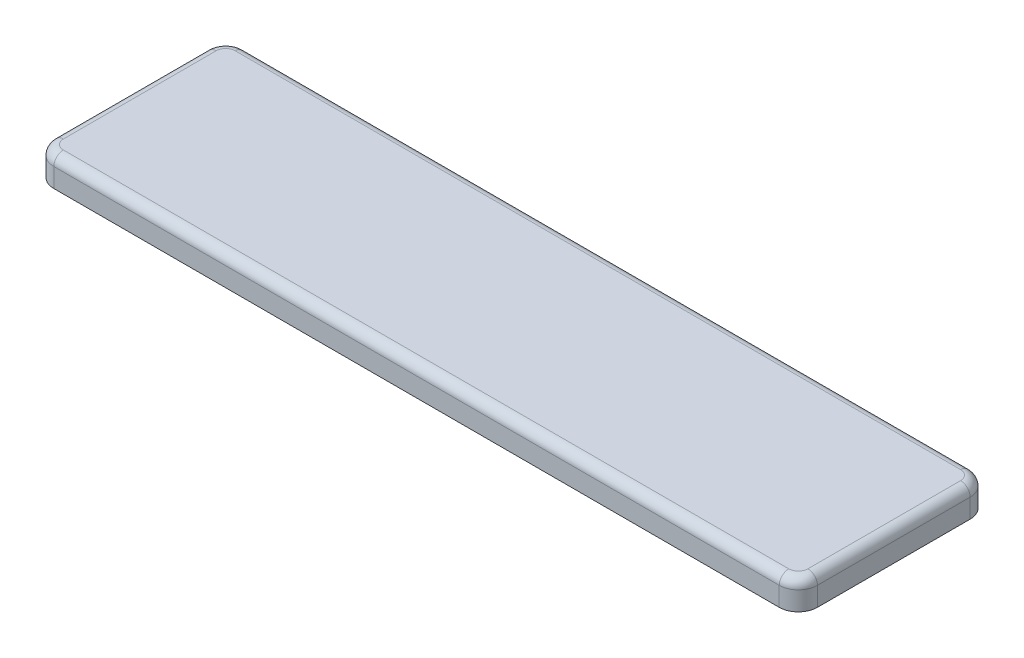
from build123d import *

# Parameters (mm, degrees)
EXTRUDE_1_DEPTH     = 1.5
FILLET_1_R          = 1
CUT_EXTRUDE_2_DEPTH = 1
SKETCH_4_W          = 2.7
SKETCH_4_H          = 4.2
EXTRUDE_4_DEPTH     = 7
FILLET_2_R          = 1


with BuildPart() as part:
    # Sketch 1 → Extrude 1 (new, symmetric)
    with BuildSketch(Plane(origin=(0, 0, 0), x_dir=(0, 0, -1), z_dir=(0, 1, 0))):
        with BuildLine():
            Line((-8, 40), (8, 40))
            ThreePointArc((8, 40), (9.414213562, 39.414213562), (10, 38))
            Line((10, 38), (10, -38))
            ThreePointArc((10, -38), (9.414213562, -39.414213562), (8, -40))
            Line((8, -40), (-8, -40))
            ThreePointArc((-8, -40), (-9.414213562, -39.414213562), (-10, -38))
            Line((-10, -38), (-10, 38))
            ThreePointArc((-10, 38), (-9.414213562, 39.414213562), (-8, 40))
        make_face()
    extrude(amount=EXTRUDE_1_DEPTH, both=True)

    # Fillet 1
    fillet_1_edges = [part.edges().sort_by_distance(p)[0] for p in [
        (-39.414213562, 1.5, 9.414213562),
        (0, 1.5, 10),
        (39.414213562, 1.5, 9.414213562),
        (40, 1.5, 0),
        (39.414213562, 1.5, -9.414213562),
        (0, 1.5, -10),
        (-39.414213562, 1.5, -9.414213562),
        (-40, 1.5, 0),
    ]]
    fillet(fillet_1_edges, radius=FILLET_1_R)

    # Sketch 2 → Cut-Extrude 2 (cut)
    with BuildSketch(Plane.XZ.offset(1.5)):
        with BuildLine():
            Line((-38, 8.8), (38, 8.8))
            ThreePointArc((38, 8.8), (38.565685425, 8.565685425), (38.8, 8))
            Line((38.8, 8), (38.8, -8))
            ThreePointArc((38.8, -8), (38.565685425, -8.565685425), (38, -8.8))
            Line((38, -8.8), (-38, -8.8))
            ThreePointArc((-38, -8.8), (-38.565685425, -8.565685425), (-38.8, -8))
            Line((-38.8, -8), (-38.8, 8))
            ThreePointArc((-38.8, 8), (-38.565685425, 8.565685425), (-38, 8.8))
        make_face()
    extrude(amount=-CUT_EXTRUDE_2_DEPTH, mode=Mode.SUBTRACT)

    # Sketch 4 → Extrude 4 (add)
    with BuildSketch(Plane.XZ.offset(0.5)):
        with Locations((-30, 0)):
            Rectangle(SKETCH_4_W, SKETCH_4_H)
        with Locations((-10, 0)):
            Rectangle(SKETCH_4_W, SKETCH_4_H)
        with Locations((10, 0)):
            Rectangle(SKETCH_4_W, SKETCH_4_H)
        with Locations((30, 0)):
            Rectangle(SKETCH_4_W, SKETCH_4_H)
    extrude(amount=EXTRUDE_4_DEPTH)

    # Fillet 2
    fillet_2_edges = [part.edges().sort_by_distance(p)[0] for p in [
        (28.65, -7.5, 0),
        (30, -7.5, -2.1),
        (31.35, -7.5, 0),
        (30, -7.5, 2.1),
        (-31.35, -7.5, 0),
        (-30, -7.5, -2.1),
        (-28.65, -7.5, 0),
        (-30, -7.5, 2.1),
        (-11.35, -7.5, 0),
        (-10, -7.5, -2.1),
        (-8.65, -7.5, 0),
        (-10, -7.5, 2.1),
        (8.65, -7.5, 0),
        (10, -7.5, -2.1),
        (11.35, -7.5, 0),
        (10, -7.5, 2.1),
    ]]
    fillet(fillet_2_edges, radius=FILLET_2_R)


solid = part.part
